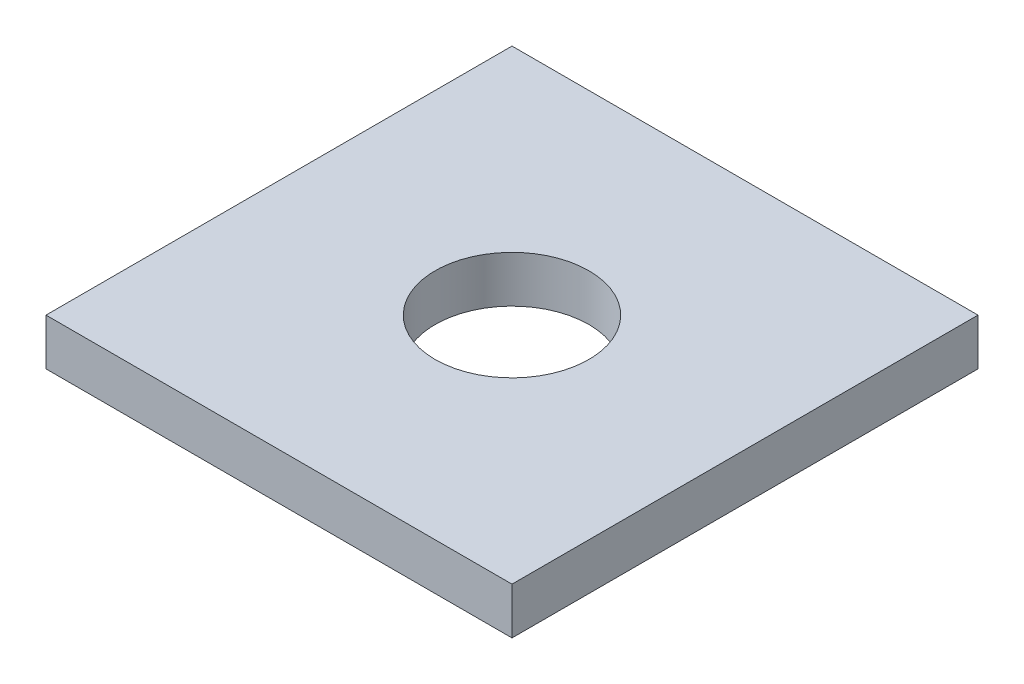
ISO-10303-21;
HEADER;
FILE_DESCRIPTION(('STEP AP214'),'2;1');
FILE_NAME('part.step','',(''),(''),'','','');
FILE_SCHEMA(('AUTOMOTIVE_DESIGN { 1 0 10303 214 1 1 1 1 }'));
ENDSEC;
DATA;
#1=APPLICATION_CONTEXT('core data for automotive mechanical design processes');
#2=APPLICATION_PROTOCOL_DEFINITION('international standard','automotive_design',2000,#1);
#3=PRODUCT_CONTEXT('',#1,'mechanical');
#4=PRODUCT('Part','Part','',(#3));
#5=PRODUCT_RELATED_PRODUCT_CATEGORY('part','',(#4));
#6=PRODUCT_DEFINITION_FORMATION('','',#4);
#7=PRODUCT_DEFINITION_CONTEXT('part definition',#1,'design');
#8=PRODUCT_DEFINITION('design','',#6,#7);
#9=PRODUCT_DEFINITION_SHAPE('','',#8);
#10=(LENGTH_UNIT() NAMED_UNIT(*) SI_UNIT(.MILLI.,.METRE.));
#11=(NAMED_UNIT(*) PLANE_ANGLE_UNIT() SI_UNIT($,.RADIAN.));
#12=(NAMED_UNIT(*) SI_UNIT($,.STERADIAN.) SOLID_ANGLE_UNIT());
#13=UNCERTAINTY_MEASURE_WITH_UNIT(LENGTH_MEASURE(1.E-05),#10,'distance_accuracy_value','');
#14=(GEOMETRIC_REPRESENTATION_CONTEXT(3) GLOBAL_UNCERTAINTY_ASSIGNED_CONTEXT((#13)) GLOBAL_UNIT_ASSIGNED_CONTEXT((#10,
#11,#12)) REPRESENTATION_CONTEXT('',''));
#15=CARTESIAN_POINT('',(0.,0.,0.));
#16=DIRECTION('',(0.,0.,1.));
#17=DIRECTION('',(1.,0.,0.));
#18=AXIS2_PLACEMENT_3D('',#15,#16,#17);
#19=CARTESIAN_POINT('',(0.,0.,0.));
#20=DIRECTION('',(0.,-1.,0.));
#21=DIRECTION('',(0.,0.,-1.));
#22=AXIS2_PLACEMENT_3D('',#19,#20,#21);
#23=PLANE('',#22);
#24=DIRECTION('',(0.,0.,-1.));
#25=VECTOR('',#24,1.);
#26=CARTESIAN_POINT('',(50.,0.,50.));
#27=LINE('',#26,#25);
#28=CARTESIAN_POINT('',(50.,0.,50.));
#29=VERTEX_POINT('',#28);
#30=CARTESIAN_POINT('',(50.,0.,-50.));
#31=VERTEX_POINT('',#30);
#32=EDGE_CURVE('E225',#29,#31,#27,.T.);
#33=ORIENTED_EDGE('',*,*,#32,.F.);
#34=DIRECTION('',(1.,0.,0.));
#35=VECTOR('',#34,1.);
#36=CARTESIAN_POINT('',(-50.,0.,50.));
#37=LINE('',#36,#35);
#38=CARTESIAN_POINT('',(-50.,0.,50.));
#39=VERTEX_POINT('',#38);
#40=EDGE_CURVE('E234',#39,#29,#37,.T.);
#41=ORIENTED_EDGE('',*,*,#40,.F.);
#42=DIRECTION('',(0.,0.,1.));
#43=VECTOR('',#42,1.);
#44=CARTESIAN_POINT('',(-50.,0.,50.));
#45=LINE('',#44,#43);
#46=CARTESIAN_POINT('',(-50.,0.,-50.));
#47=VERTEX_POINT('',#46);
#48=EDGE_CURVE('E250',#47,#39,#45,.T.);
#49=ORIENTED_EDGE('',*,*,#48,.F.);
#50=DIRECTION('',(-1.,0.,0.));
#51=VECTOR('',#50,1.);
#52=CARTESIAN_POINT('',(-50.,0.,-50.));
#53=LINE('',#52,#51);
#54=EDGE_CURVE('E247',#31,#47,#53,.T.);
#55=ORIENTED_EDGE('',*,*,#54,.F.);
#56=EDGE_LOOP('',(#33,#41,#49,#55));
#57=FACE_BOUND('',#56,.T.);
#58=DIRECTION('',(-1.,0.,0.));
#59=VECTOR('',#58,1.);
#60=CARTESIAN_POINT('',(-40.,0.,40.));
#61=LINE('',#60,#59);
#62=CARTESIAN_POINT('',(40.,0.,40.));
#63=VERTEX_POINT('',#62);
#64=CARTESIAN_POINT('',(-40.,0.,40.));
#65=VERTEX_POINT('',#64);
#66=EDGE_CURVE('E200',#63,#65,#61,.T.);
#67=ORIENTED_EDGE('',*,*,#66,.F.);
#68=DIRECTION('',(0.,0.,1.));
#69=VECTOR('',#68,1.);
#70=CARTESIAN_POINT('',(40.,0.,-40.));
#71=LINE('',#70,#69);
#72=CARTESIAN_POINT('',(40.,0.,-40.));
#73=VERTEX_POINT('',#72);
#74=EDGE_CURVE('E150',#73,#63,#71,.T.);
#75=ORIENTED_EDGE('',*,*,#74,.F.);
#76=DIRECTION('',(1.,0.,0.));
#77=VECTOR('',#76,1.);
#78=CARTESIAN_POINT('',(-40.,0.,-40.));
#79=LINE('',#78,#77);
#80=CARTESIAN_POINT('',(-40.,0.,-40.));
#81=VERTEX_POINT('',#80);
#82=EDGE_CURVE('E187',#81,#73,#79,.T.);
#83=ORIENTED_EDGE('',*,*,#82,.F.);
#84=DIRECTION('',(0.,0.,-1.));
#85=VECTOR('',#84,1.);
#86=CARTESIAN_POINT('',(-40.,0.,-40.));
#87=LINE('',#86,#85);
#88=EDGE_CURVE('E203',#65,#81,#87,.T.);
#89=ORIENTED_EDGE('',*,*,#88,.F.);
#90=EDGE_LOOP('',(#67,#75,#83,#89));
#91=FACE_BOUND('',#90,.T.);
#92=ADVANCED_FACE('F39',(#57,#91),#23,.T.);
#93=CARTESIAN_POINT('',(0.,10.,0.));
#94=DIRECTION('',(0.,-1.,0.));
#95=DIRECTION('',(0.,0.,-1.));
#96=AXIS2_PLACEMENT_3D('',#93,#94,#95);
#97=PLANE('',#96);
#98=DIRECTION('',(0.,0.,-1.));
#99=VECTOR('',#98,1.);
#100=CARTESIAN_POINT('',(50.,10.,50.));
#101=LINE('',#100,#99);
#102=CARTESIAN_POINT('',(50.,10.,50.));
#103=VERTEX_POINT('',#102);
#104=CARTESIAN_POINT('',(50.,10.,-50.));
#105=VERTEX_POINT('',#104);
#106=EDGE_CURVE('E229',#103,#105,#101,.T.);
#107=ORIENTED_EDGE('',*,*,#106,.T.);
#108=DIRECTION('',(-1.,0.,0.));
#109=VECTOR('',#108,1.);
#110=CARTESIAN_POINT('',(-50.,10.,-50.));
#111=LINE('',#110,#109);
#112=CARTESIAN_POINT('',(-50.,10.,-50.));
#113=VERTEX_POINT('',#112);
#114=EDGE_CURVE('E233',#105,#113,#111,.T.);
#115=ORIENTED_EDGE('',*,*,#114,.T.);
#116=DIRECTION('',(0.,0.,1.));
#117=VECTOR('',#116,1.);
#118=CARTESIAN_POINT('',(-50.,10.,50.));
#119=LINE('',#118,#117);
#120=CARTESIAN_POINT('',(-50.,10.,50.));
#121=VERTEX_POINT('',#120);
#122=EDGE_CURVE('E237',#113,#121,#119,.T.);
#123=ORIENTED_EDGE('',*,*,#122,.T.);
#124=DIRECTION('',(1.,0.,0.));
#125=VECTOR('',#124,1.);
#126=CARTESIAN_POINT('',(-50.,10.,50.));
#127=LINE('',#126,#125);
#128=EDGE_CURVE('E240',#121,#103,#127,.T.);
#129=ORIENTED_EDGE('',*,*,#128,.T.);
#130=EDGE_LOOP('',(#107,#115,#123,#129));
#131=FACE_BOUND('',#130,.T.);
#132=CARTESIAN_POINT('',(0.,10.,0.));
#133=DIRECTION('',(0.,1.,0.));
#134=DIRECTION('',(0.,0.,1.));
#135=AXIS2_PLACEMENT_3D('',#132,#133,#134);
#136=CIRCLE('',#135,16.5);
#137=CARTESIAN_POINT('',(0.,10.,16.5));
#138=VERTEX_POINT('',#137);
#139=EDGE_CURVE('E221',#138,#138,#136,.T.);
#140=ORIENTED_EDGE('',*,*,#139,.F.);
#141=EDGE_LOOP('',(#140));
#142=FACE_BOUND('',#141,.T.);
#143=ADVANCED_FACE('F282',(#131,#142),#97,.F.);
#144=DIRECTION('',(0.,0.,-1.));
#145=VECTOR('',#144,1.);
#146=CARTESIAN_POINT('',(-36.,0.,-36.));
#147=LINE('',#146,#145);
#148=CARTESIAN_POINT('',(-36.,0.,36.));
#149=VERTEX_POINT('',#148);
#150=CARTESIAN_POINT('',(-36.,0.,-36.));
#151=VERTEX_POINT('',#150);
#152=EDGE_CURVE('E63',#149,#151,#147,.T.);
#153=ORIENTED_EDGE('',*,*,#152,.T.);
#154=DIRECTION('',(1.,0.,0.));
#155=VECTOR('',#154,1.);
#156=CARTESIAN_POINT('',(-36.,0.,-36.));
#157=LINE('',#156,#155);
#158=CARTESIAN_POINT('',(36.,0.,-36.));
#159=VERTEX_POINT('',#158);
#160=EDGE_CURVE('E148',#151,#159,#157,.T.);
#161=ORIENTED_EDGE('',*,*,#160,.T.);
#162=DIRECTION('',(0.,0.,1.));
#163=VECTOR('',#162,1.);
#164=CARTESIAN_POINT('',(36.,0.,-36.));
#165=LINE('',#164,#163);
#166=CARTESIAN_POINT('',(36.,0.,36.));
#167=VERTEX_POINT('',#166);
#168=EDGE_CURVE('E169',#159,#167,#165,.T.);
#169=ORIENTED_EDGE('',*,*,#168,.T.);
#170=DIRECTION('',(-1.,0.,0.));
#171=VECTOR('',#170,1.);
#172=CARTESIAN_POINT('',(-36.,0.,36.));
#173=LINE('',#172,#171);
#174=EDGE_CURVE('E142',#167,#149,#173,.T.);
#175=ORIENTED_EDGE('',*,*,#174,.T.);
#176=EDGE_LOOP('',(#153,#161,#169,#175));
#177=FACE_BOUND('',#176,.T.);
#178=CARTESIAN_POINT('',(0.,0.,0.));
#179=DIRECTION('',(0.,1.,0.));
#180=DIRECTION('',(0.,0.,1.));
#181=AXIS2_PLACEMENT_3D('',#178,#179,#180);
#182=CIRCLE('',#181,16.5);
#183=CARTESIAN_POINT('',(0.,0.,16.5));
#184=VERTEX_POINT('',#183);
#185=EDGE_CURVE('E220',#184,#184,#182,.T.);
#186=ORIENTED_EDGE('',*,*,#185,.T.);
#187=EDGE_LOOP('',(#186));
#188=FACE_BOUND('',#187,.T.);
#189=ADVANCED_FACE('F291',(#177,#188),#23,.T.);
#190=CARTESIAN_POINT('',(50.,10.,50.));
#191=DIRECTION('',(-1.,0.,0.));
#192=DIRECTION('',(0.,0.,1.));
#193=AXIS2_PLACEMENT_3D('',#190,#191,#192);
#194=PLANE('',#193);
#195=ORIENTED_EDGE('',*,*,#32,.T.);
#196=DIRECTION('',(0.,-1.,0.));
#197=VECTOR('',#196,1.);
#198=CARTESIAN_POINT('',(50.,10.,-50.));
#199=LINE('',#198,#197);
#200=EDGE_CURVE('E11',#105,#31,#199,.T.);
#201=ORIENTED_EDGE('',*,*,#200,.F.);
#202=ORIENTED_EDGE('',*,*,#106,.F.);
#203=DIRECTION('',(0.,-1.,0.));
#204=VECTOR('',#203,1.);
#205=CARTESIAN_POINT('',(50.,10.,50.));
#206=LINE('',#205,#204);
#207=EDGE_CURVE('E243',#103,#29,#206,.T.);
#208=ORIENTED_EDGE('',*,*,#207,.T.);
#209=EDGE_LOOP('',(#195,#201,#202,#208));
#210=FACE_BOUND('',#209,.T.);
#211=ADVANCED_FACE('F41',(#210),#194,.F.);
#212=CARTESIAN_POINT('',(-50.,10.,-50.));
#213=DIRECTION('',(0.,0.,1.));
#214=DIRECTION('',(1.,0.,0.));
#215=AXIS2_PLACEMENT_3D('',#212,#213,#214);
#216=PLANE('',#215);
#217=ORIENTED_EDGE('',*,*,#54,.T.);
#218=DIRECTION('',(0.,-1.,0.));
#219=VECTOR('',#218,1.);
#220=CARTESIAN_POINT('',(-50.,10.,-50.));
#221=LINE('',#220,#219);
#222=EDGE_CURVE('E48',#113,#47,#221,.T.);
#223=ORIENTED_EDGE('',*,*,#222,.F.);
#224=ORIENTED_EDGE('',*,*,#114,.F.);
#225=ORIENTED_EDGE('',*,*,#200,.T.);
#226=EDGE_LOOP('',(#217,#223,#224,#225));
#227=FACE_BOUND('',#226,.T.);
#228=ADVANCED_FACE('F284',(#227),#216,.F.);
#229=CARTESIAN_POINT('',(-50.,10.,50.));
#230=DIRECTION('',(1.,0.,0.));
#231=DIRECTION('',(0.,0.,-1.));
#232=AXIS2_PLACEMENT_3D('',#229,#230,#231);
#233=PLANE('',#232);
#234=ORIENTED_EDGE('',*,*,#48,.T.);
#235=DIRECTION('',(0.,-1.,0.));
#236=VECTOR('',#235,1.);
#237=CARTESIAN_POINT('',(-50.,10.,50.));
#238=LINE('',#237,#236);
#239=EDGE_CURVE('E258',#121,#39,#238,.T.);
#240=ORIENTED_EDGE('',*,*,#239,.F.);
#241=ORIENTED_EDGE('',*,*,#122,.F.);
#242=ORIENTED_EDGE('',*,*,#222,.T.);
#243=EDGE_LOOP('',(#234,#240,#241,#242));
#244=FACE_BOUND('',#243,.T.);
#245=ADVANCED_FACE('F267',(#244),#233,.F.);
#246=CARTESIAN_POINT('',(-50.,10.,50.));
#247=DIRECTION('',(0.,0.,-1.));
#248=DIRECTION('',(-1.,0.,0.));
#249=AXIS2_PLACEMENT_3D('',#246,#247,#248);
#250=PLANE('',#249);
#251=ORIENTED_EDGE('',*,*,#40,.T.);
#252=ORIENTED_EDGE('',*,*,#207,.F.);
#253=ORIENTED_EDGE('',*,*,#128,.F.);
#254=ORIENTED_EDGE('',*,*,#239,.T.);
#255=EDGE_LOOP('',(#251,#252,#253,#254));
#256=FACE_BOUND('',#255,.T.);
#257=ADVANCED_FACE('F276',(#256),#250,.F.);
#258=CARTESIAN_POINT('',(0.,10.,0.));
#259=DIRECTION('',(0.,-1.,0.));
#260=DIRECTION('',(0.,0.,-1.));
#261=AXIS2_PLACEMENT_3D('',#258,#259,#260);
#262=CYLINDRICAL_SURFACE('',#261,16.5);
#263=ORIENTED_EDGE('',*,*,#139,.T.);
#264=EDGE_LOOP('',(#263));
#265=FACE_BOUND('',#264,.T.);
#266=ORIENTED_EDGE('',*,*,#185,.F.);
#267=EDGE_LOOP('',(#266));
#268=FACE_BOUND('',#267,.T.);
#269=ADVANCED_FACE('F305',(#265,#268),#262,.F.);
#270=CARTESIAN_POINT('',(0.,-10.,0.));
#271=DIRECTION('',(0.,1.,0.));
#272=DIRECTION('',(0.,0.,1.));
#273=AXIS2_PLACEMENT_3D('',#270,#271,#272);
#274=PLANE('',#273);
#275=DIRECTION('',(0.,0.,1.));
#276=VECTOR('',#275,1.);
#277=CARTESIAN_POINT('',(40.,-10.,-40.));
#278=LINE('',#277,#276);
#279=CARTESIAN_POINT('',(40.,-10.,-40.));
#280=VERTEX_POINT('',#279);
#281=CARTESIAN_POINT('',(40.,-10.,40.));
#282=VERTEX_POINT('',#281);
#283=EDGE_CURVE('E182',#280,#282,#278,.T.);
#284=ORIENTED_EDGE('',*,*,#283,.T.);
#285=DIRECTION('',(-1.,0.,0.));
#286=VECTOR('',#285,1.);
#287=CARTESIAN_POINT('',(-40.,-10.,40.));
#288=LINE('',#287,#286);
#289=CARTESIAN_POINT('',(-40.,-10.,40.));
#290=VERTEX_POINT('',#289);
#291=EDGE_CURVE('E186',#282,#290,#288,.T.);
#292=ORIENTED_EDGE('',*,*,#291,.T.);
#293=DIRECTION('',(0.,0.,-1.));
#294=VECTOR('',#293,1.);
#295=CARTESIAN_POINT('',(-40.,-10.,-40.));
#296=LINE('',#295,#294);
#297=CARTESIAN_POINT('',(-40.,-10.,-40.));
#298=VERTEX_POINT('',#297);
#299=EDGE_CURVE('E190',#290,#298,#296,.T.);
#300=ORIENTED_EDGE('',*,*,#299,.T.);
#301=DIRECTION('',(1.,0.,0.));
#302=VECTOR('',#301,1.);
#303=CARTESIAN_POINT('',(-40.,-10.,-40.));
#304=LINE('',#303,#302);
#305=EDGE_CURVE('E193',#298,#280,#304,.T.);
#306=ORIENTED_EDGE('',*,*,#305,.T.);
#307=EDGE_LOOP('',(#284,#292,#300,#306));
#308=FACE_BOUND('',#307,.T.);
#309=DIRECTION('',(0.,0.,-1.));
#310=VECTOR('',#309,1.);
#311=CARTESIAN_POINT('',(-36.,-10.,-36.));
#312=LINE('',#311,#310);
#313=CARTESIAN_POINT('',(-36.,-10.,36.));
#314=VERTEX_POINT('',#313);
#315=CARTESIAN_POINT('',(-36.,-10.,-36.));
#316=VERTEX_POINT('',#315);
#317=EDGE_CURVE('E131',#314,#316,#312,.T.);
#318=ORIENTED_EDGE('',*,*,#317,.F.);
#319=DIRECTION('',(-1.,0.,0.));
#320=VECTOR('',#319,1.);
#321=CARTESIAN_POINT('',(-36.,-10.,36.));
#322=LINE('',#321,#320);
#323=CARTESIAN_POINT('',(36.,-10.,36.));
#324=VERTEX_POINT('',#323);
#325=EDGE_CURVE('E160',#324,#314,#322,.T.);
#326=ORIENTED_EDGE('',*,*,#325,.F.);
#327=DIRECTION('',(0.,0.,1.));
#328=VECTOR('',#327,1.);
#329=CARTESIAN_POINT('',(36.,-10.,-36.));
#330=LINE('',#329,#328);
#331=CARTESIAN_POINT('',(36.,-10.,-36.));
#332=VERTEX_POINT('',#331);
#333=EDGE_CURVE('E156',#332,#324,#330,.T.);
#334=ORIENTED_EDGE('',*,*,#333,.F.);
#335=DIRECTION('',(1.,0.,0.));
#336=VECTOR('',#335,1.);
#337=CARTESIAN_POINT('',(-36.,-10.,-36.));
#338=LINE('',#337,#336);
#339=EDGE_CURVE('E141',#316,#332,#338,.T.);
#340=ORIENTED_EDGE('',*,*,#339,.F.);
#341=EDGE_LOOP('',(#318,#326,#334,#340));
#342=FACE_BOUND('',#341,.T.);
#343=ADVANCED_FACE('F154',(#308,#342),#274,.F.);
#344=CARTESIAN_POINT('',(40.,-10.,-40.));
#345=DIRECTION('',(-1.,0.,0.));
#346=DIRECTION('',(0.,0.,1.));
#347=AXIS2_PLACEMENT_3D('',#344,#345,#346);
#348=PLANE('',#347);
#349=ORIENTED_EDGE('',*,*,#74,.T.);
#350=DIRECTION('',(0.,1.,0.));
#351=VECTOR('',#350,1.);
#352=CARTESIAN_POINT('',(40.,-10.,40.));
#353=LINE('',#352,#351);
#354=EDGE_CURVE('E217',#282,#63,#353,.T.);
#355=ORIENTED_EDGE('',*,*,#354,.F.);
#356=ORIENTED_EDGE('',*,*,#283,.F.);
#357=DIRECTION('',(0.,1.,0.));
#358=VECTOR('',#357,1.);
#359=CARTESIAN_POINT('',(40.,-10.,-40.));
#360=LINE('',#359,#358);
#361=EDGE_CURVE('E196',#280,#73,#360,.T.);
#362=ORIENTED_EDGE('',*,*,#361,.T.);
#363=EDGE_LOOP('',(#349,#355,#356,#362));
#364=FACE_BOUND('',#363,.T.);
#365=ADVANCED_FACE('F313',(#364),#348,.F.);
#366=CARTESIAN_POINT('',(-40.,-10.,40.));
#367=DIRECTION('',(0.,0.,-1.));
#368=DIRECTION('',(-1.,0.,0.));
#369=AXIS2_PLACEMENT_3D('',#366,#367,#368);
#370=PLANE('',#369);
#371=ORIENTED_EDGE('',*,*,#66,.T.);
#372=DIRECTION('',(0.,1.,0.));
#373=VECTOR('',#372,1.);
#374=CARTESIAN_POINT('',(-40.,-10.,40.));
#375=LINE('',#374,#373);
#376=EDGE_CURVE('E213',#290,#65,#375,.T.);
#377=ORIENTED_EDGE('',*,*,#376,.F.);
#378=ORIENTED_EDGE('',*,*,#291,.F.);
#379=ORIENTED_EDGE('',*,*,#354,.T.);
#380=EDGE_LOOP('',(#371,#377,#378,#379));
#381=FACE_BOUND('',#380,.T.);
#382=ADVANCED_FACE('F319',(#381),#370,.F.);
#383=CARTESIAN_POINT('',(-40.,-10.,-40.));
#384=DIRECTION('',(1.,0.,0.));
#385=DIRECTION('',(0.,0.,-1.));
#386=AXIS2_PLACEMENT_3D('',#383,#384,#385);
#387=PLANE('',#386);
#388=ORIENTED_EDGE('',*,*,#88,.T.);
#389=DIRECTION('',(0.,1.,0.));
#390=VECTOR('',#389,1.);
#391=CARTESIAN_POINT('',(-40.,-10.,-40.));
#392=LINE('',#391,#390);
#393=EDGE_CURVE('E55',#298,#81,#392,.T.);
#394=ORIENTED_EDGE('',*,*,#393,.F.);
#395=ORIENTED_EDGE('',*,*,#299,.F.);
#396=ORIENTED_EDGE('',*,*,#376,.T.);
#397=EDGE_LOOP('',(#388,#394,#395,#396));
#398=FACE_BOUND('',#397,.T.);
#399=ADVANCED_FACE('F323',(#398),#387,.F.);
#400=CARTESIAN_POINT('',(-40.,-10.,-40.));
#401=DIRECTION('',(0.,0.,1.));
#402=DIRECTION('',(1.,0.,0.));
#403=AXIS2_PLACEMENT_3D('',#400,#401,#402);
#404=PLANE('',#403);
#405=ORIENTED_EDGE('',*,*,#82,.T.);
#406=ORIENTED_EDGE('',*,*,#361,.F.);
#407=ORIENTED_EDGE('',*,*,#305,.F.);
#408=ORIENTED_EDGE('',*,*,#393,.T.);
#409=EDGE_LOOP('',(#405,#406,#407,#408));
#410=FACE_BOUND('',#409,.T.);
#411=ADVANCED_FACE('F327',(#410),#404,.F.);
#412=CARTESIAN_POINT('',(-36.,-10.,-36.));
#413=DIRECTION('',(1.,0.,0.));
#414=DIRECTION('',(0.,0.,-1.));
#415=AXIS2_PLACEMENT_3D('',#412,#413,#414);
#416=PLANE('',#415);
#417=ORIENTED_EDGE('',*,*,#152,.F.);
#418=DIRECTION('',(0.,1.,0.));
#419=VECTOR('',#418,1.);
#420=CARTESIAN_POINT('',(-36.,-10.,36.));
#421=LINE('',#420,#419);
#422=EDGE_CURVE('E136',#314,#149,#421,.T.);
#423=ORIENTED_EDGE('',*,*,#422,.F.);
#424=ORIENTED_EDGE('',*,*,#317,.T.);
#425=DIRECTION('',(0.,1.,0.));
#426=VECTOR('',#425,1.);
#427=CARTESIAN_POINT('',(-36.,-10.,-36.));
#428=LINE('',#427,#426);
#429=EDGE_CURVE('E134',#316,#151,#428,.T.);
#430=ORIENTED_EDGE('',*,*,#429,.T.);
#431=EDGE_LOOP('',(#417,#423,#424,#430));
#432=FACE_BOUND('',#431,.T.);
#433=ADVANCED_FACE('F133',(#432),#416,.T.);
#434=CARTESIAN_POINT('',(-36.,-10.,-36.));
#435=DIRECTION('',(0.,0.,1.));
#436=DIRECTION('',(1.,0.,0.));
#437=AXIS2_PLACEMENT_3D('',#434,#435,#436);
#438=PLANE('',#437);
#439=ORIENTED_EDGE('',*,*,#160,.F.);
#440=ORIENTED_EDGE('',*,*,#429,.F.);
#441=ORIENTED_EDGE('',*,*,#339,.T.);
#442=DIRECTION('',(0.,1.,0.));
#443=VECTOR('',#442,1.);
#444=CARTESIAN_POINT('',(36.,-10.,-36.));
#445=LINE('',#444,#443);
#446=EDGE_CURVE('E151',#332,#159,#445,.T.);
#447=ORIENTED_EDGE('',*,*,#446,.T.);
#448=EDGE_LOOP('',(#439,#440,#441,#447));
#449=FACE_BOUND('',#448,.T.);
#450=ADVANCED_FACE('F145',(#449),#438,.T.);
#451=CARTESIAN_POINT('',(36.,-10.,-36.));
#452=DIRECTION('',(-1.,0.,0.));
#453=DIRECTION('',(0.,0.,1.));
#454=AXIS2_PLACEMENT_3D('',#451,#452,#453);
#455=PLANE('',#454);
#456=ORIENTED_EDGE('',*,*,#168,.F.);
#457=ORIENTED_EDGE('',*,*,#446,.F.);
#458=ORIENTED_EDGE('',*,*,#333,.T.);
#459=DIRECTION('',(0.,1.,0.));
#460=VECTOR('',#459,1.);
#461=CARTESIAN_POINT('',(36.,-10.,36.));
#462=LINE('',#461,#460);
#463=EDGE_CURVE('E176',#324,#167,#462,.T.);
#464=ORIENTED_EDGE('',*,*,#463,.T.);
#465=EDGE_LOOP('',(#456,#457,#458,#464));
#466=FACE_BOUND('',#465,.T.);
#467=ADVANCED_FACE('F335',(#466),#455,.T.);
#468=CARTESIAN_POINT('',(-36.,-10.,36.));
#469=DIRECTION('',(0.,0.,-1.));
#470=DIRECTION('',(-1.,0.,0.));
#471=AXIS2_PLACEMENT_3D('',#468,#469,#470);
#472=PLANE('',#471);
#473=ORIENTED_EDGE('',*,*,#174,.F.);
#474=ORIENTED_EDGE('',*,*,#463,.F.);
#475=ORIENTED_EDGE('',*,*,#325,.T.);
#476=ORIENTED_EDGE('',*,*,#422,.T.);
#477=EDGE_LOOP('',(#473,#474,#475,#476));
#478=FACE_BOUND('',#477,.T.);
#479=ADVANCED_FACE('F338',(#478),#472,.T.);
#480=CLOSED_SHELL('',(#92,#143,#189,#211,#228,#245,#257,#269,#343,#365,#382,#399,#411,#433,#450,
#467,#479));
#481=MANIFOLD_SOLID_BREP('B2',#480);
#482=ADVANCED_BREP_SHAPE_REPRESENTATION('',(#18,#481),#14);
#483=SHAPE_DEFINITION_REPRESENTATION(#9,#482);
ENDSEC;
END-ISO-10303-21;
